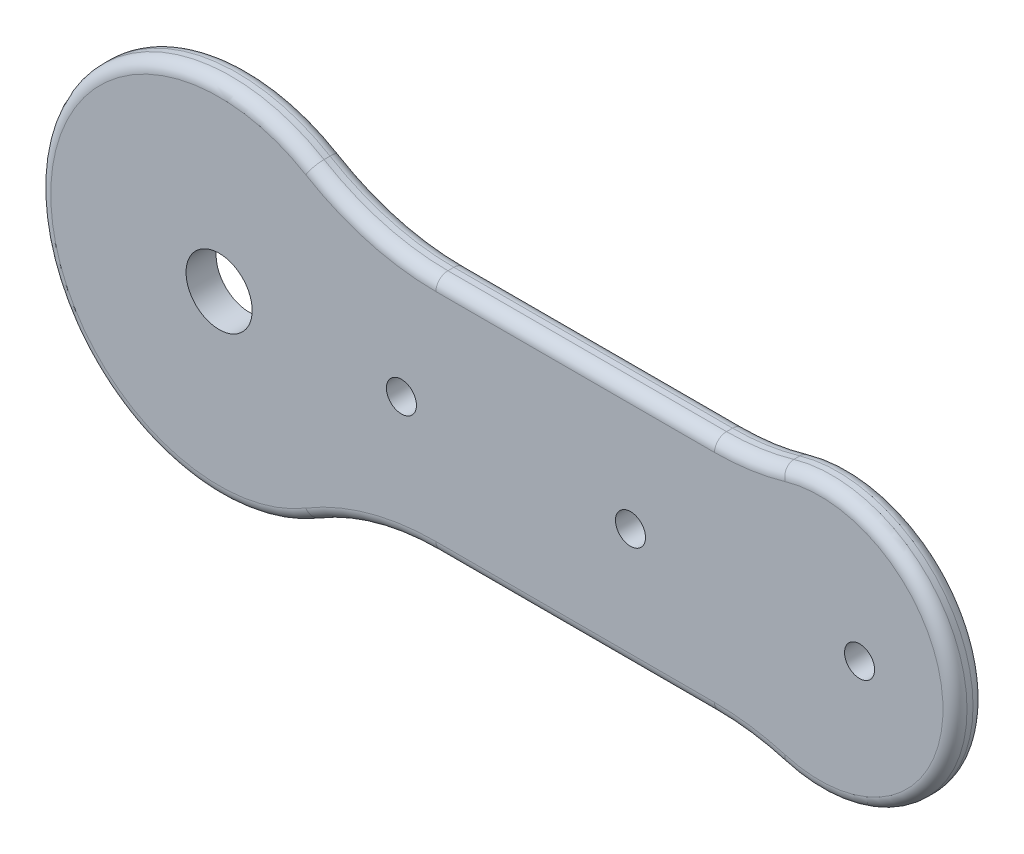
from build123d import *

# Parameters (mm, degrees)
SKETCH1_R           = 11
SKETCH1_R_2         = 5
BOSS_EXTRUDE1_DEPTH = 10
FILLET1_R           = 80
FILLET2_R           = 4


with BuildPart() as part:
    # Sketch1 → Boss-Extrude1 (new body)
    with BuildSketch(Plane.XY):
        with BuildLine():
            ThreePointArc((-55.17864045, 40), (-159.9, 0), (-55.17864045, -40))
            Line((-55.17864045, -40), (79.284471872, -40))
            ThreePointArc((79.284471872, -40), (144.9, 0), (79.284471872, 40))
            Line((79.284471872, 40), (-55.17864045, 40))
        make_face()
        with Locations((-99.9, 0)):
            Circle(SKETCH1_R, mode=Mode.SUBTRACT)
        with Locations((-39.25, 0)):
            Circle(SKETCH1_R_2, mode=Mode.SUBTRACT)
        with Locations((36.95, 0)):
            Circle(SKETCH1_R_2, mode=Mode.SUBTRACT)
        with Locations((113.15, 0)):
            Circle(SKETCH1_R_2, mode=Mode.SUBTRACT)
    extrude(amount=BOSS_EXTRUDE1_DEPTH)

    # Fillet1
    fillet1_edges = [part.edges().sort_by_distance(p)[0] for p in [
        (79.284471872, 40, 5),
        (79.284471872, -40, 5),
        (-55.17864045, -40, 5),
        (-55.17864045, 40, 5),
    ]]
    fillet(fillet1_edges, radius=FILLET1_R)

    # Fillet2
    fillet2_edges = [part.edges().sort_by_distance(p)[0] for p in [
        (18.555512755, -40, 0),
        (18.555512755, -40, 10),
        (-159.9, 0, 0),
        (-159.9, 0, 10),
        (18.555512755, 40, 0),
        (18.555512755, 40, 10),
        (144.9, 0, 0),
        (144.9, 0, 10),
        (-49.169873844, -42.910071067, 0),
        (-49.169873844, -42.910071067, 10),
        (-49.169873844, 42.910071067, 0),
        (-49.169873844, 42.910071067, 10),
        (76.213708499, -40.804040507, 0),
        (76.213708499, -40.804040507, 10),
        (76.213708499, 40.804040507, 0),
        (76.213708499, 40.804040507, 10),
    ]]
    fillet(fillet2_edges, radius=FILLET2_R)


solid = part.part
